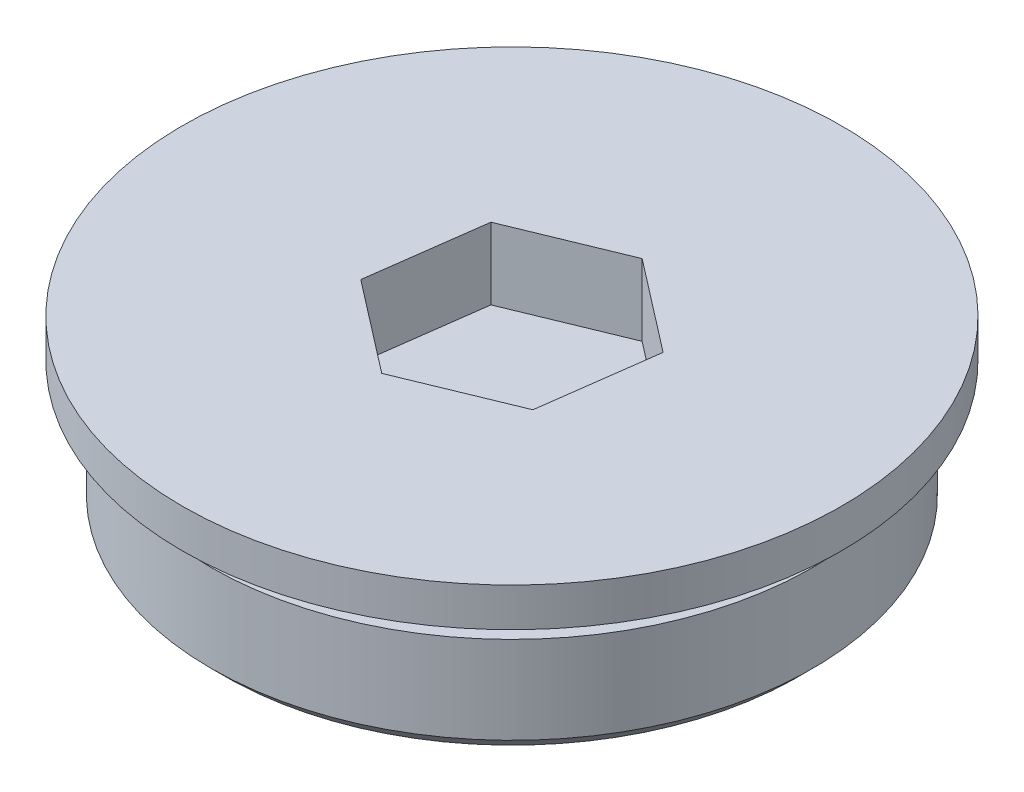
from build123d import *

# Parameters (mm, degrees)
CHANFREIN1_SIZE         = 1
ENL_V_MAT_EXTRU_1_DEPTH = 5


with BuildPart() as part:
    # Esquisse1 → Base-R_volution (revolve)
    with BuildSketch(Plane.XY, mode=Mode.PRIVATE) as base_r_volution_sk:
        Polygon((0, 0), (-19, 0), (-19, -2), (-21, -2), (-21, 5.1), (-20, 5.1), (-20, 7.1), (-23, 7.1), (-23, 9.8), (0, 9.8), align=None)
    revolve(base_r_volution_sk.sketch.rotate(Axis((0, 63, 0), (0, -1, 0)), 270), axis=Axis((0, 63, 0), (0, -1, 0)))

    # Chanfrein1
    chanfrein1_edges = [part.edges().sort_by_distance(p)[0] for p in [
        (0, -2, -21),
    ]]
    chamfer(chanfrein1_edges, length=CHANFREIN1_SIZE)

    # Esquisse2 → Enl_v. mat.-Extru.1 (cut)
    with BuildSketch(Plane(origin=(0, 9.8, 0), x_dir=(-1, 0, 0), z_dir=(0, 1, 0))):
        Polygon((1.075341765, 8.011053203), (-6.400104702, 4.936799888), (-7.475446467, -3.074253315), (-1.075341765, -8.011053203), (6.400104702, -4.936799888), (7.475446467, 3.074253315), align=None)
    extrude(amount=-ENL_V_MAT_EXTRU_1_DEPTH, mode=Mode.SUBTRACT)


solid = part.part
